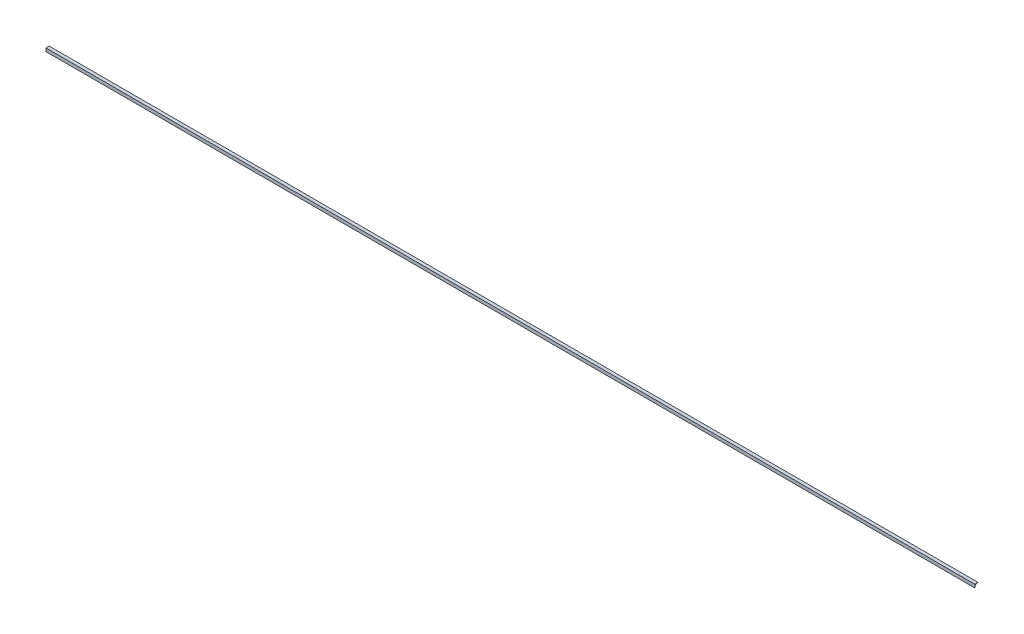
from build123d import *

# Parameters (mm, degrees)
APPLIED_CORNER_CAULK_DEPTH = 457.2


with BuildPart() as part:
    # Sketch1 → Applied_corner_caulk (new body)
    with BuildSketch(Plane.YZ):
        Polygon((76.2, 76.2), (74.6125, 76.2), (74.922205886, 76.169496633), (75.220009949, 76.079158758), (75.494467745, 75.93245801), (75.735032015, 75.735032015), (75.93245801, 75.494467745), (76.079158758, 75.220009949), (76.169496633, 74.922205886), (76.2, 74.6125), align=None)
    extrude(amount=APPLIED_CORNER_CAULK_DEPTH)


solid = part.part
